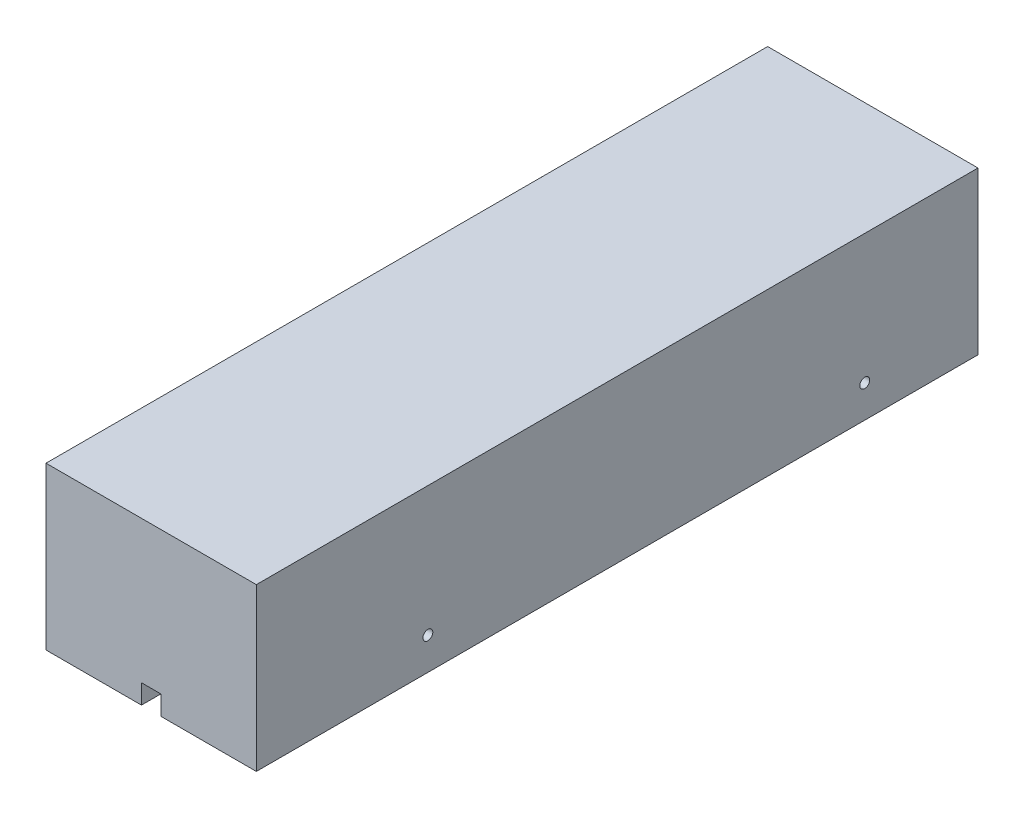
from build123d import *

# Parameters (mm, degrees)
SKETCH1_W                = 65
SKETCH1_H                = 50
BALSA_BLOCK_DEPTH        = 223
SKETCH2_W                = 6
SKETCH2_H                = 6
SCREW_EYE_SLOT_DEPTH     = 231.835980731
SKETCH3_R                = 9.55
CO2_CARTRIDGE_HOLE_DEPTH = 52
SKETCH4_R                = 1.525
AXLE_HOLE_CUT_OUT_DEPTH  = 238.60050505


with BuildPart() as part:
    # Sketch1 → Balsa Block (new body)
    with BuildSketch(Plane.XY):
        with Locations((0, 25)):
            Rectangle(SKETCH1_W, SKETCH1_H)
    extrude(amount=BALSA_BLOCK_DEPTH)

    # Sketch2 → Screw Eye Slot (cut, through all)
    with BuildSketch(Plane.XY.offset(223)):
        with Locations((0, 3)):
            Rectangle(SKETCH2_W, SKETCH2_H)
    extrude(amount=-SCREW_EYE_SLOT_DEPTH, mode=Mode.SUBTRACT)

    # Sketch3 → CO2 Cartridge Hole (cut)
    with BuildSketch(Plane(origin=(0, 0, 0), x_dir=(-1, 0, 0), z_dir=(0, 0, -1))):
        with Locations((0, 29)):
            Circle(SKETCH3_R)
    extrude(amount=-CO2_CARTRIDGE_HOLE_DEPTH, mode=Mode.SUBTRACT)

    # Sketch4 → Axle Hole Cut Out (cut, through all)
    with BuildSketch(Plane(origin=(32.5, 0, 0), x_dir=(0, 0, -1), z_dir=(1, 0, 0))):
        with Locations((-170, 10)):
            Circle(SKETCH4_R)
        with Locations((-35, 10)):
            Circle(SKETCH4_R)
    extrude(amount=-AXLE_HOLE_CUT_OUT_DEPTH, mode=Mode.SUBTRACT)


solid = part.part
